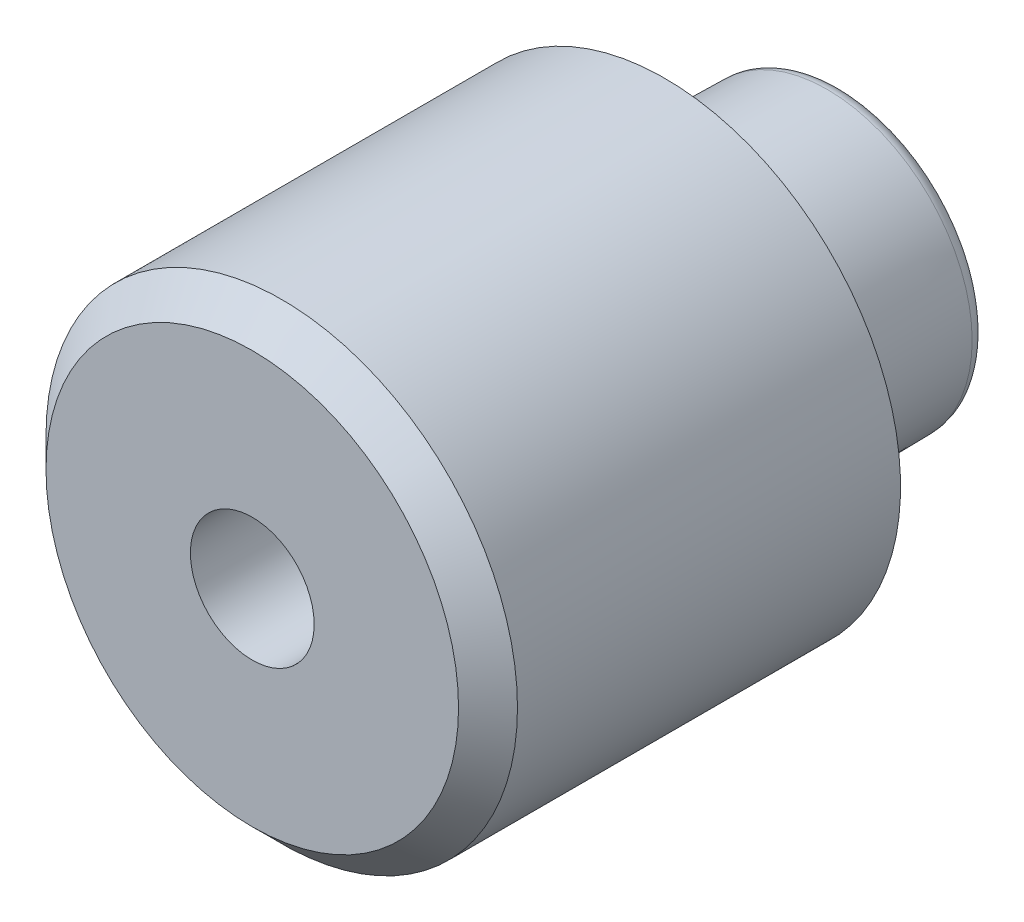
ISO-10303-21;
HEADER;
FILE_DESCRIPTION(('STEP AP214'),'2;1');
FILE_NAME('part.step','',(''),(''),'','','');
FILE_SCHEMA(('AUTOMOTIVE_DESIGN { 1 0 10303 214 1 1 1 1 }'));
ENDSEC;
DATA;
#1=APPLICATION_CONTEXT('core data for automotive mechanical design processes');
#2=APPLICATION_PROTOCOL_DEFINITION('international standard','automotive_design',2000,#1);
#3=PRODUCT_CONTEXT('',#1,'mechanical');
#4=PRODUCT('Part','Part','',(#3));
#5=PRODUCT_RELATED_PRODUCT_CATEGORY('part','',(#4));
#6=PRODUCT_DEFINITION_FORMATION('','',#4);
#7=PRODUCT_DEFINITION_CONTEXT('part definition',#1,'design');
#8=PRODUCT_DEFINITION('design','',#6,#7);
#9=PRODUCT_DEFINITION_SHAPE('','',#8);
#10=(LENGTH_UNIT() NAMED_UNIT(*) SI_UNIT(.MILLI.,.METRE.));
#11=(NAMED_UNIT(*) PLANE_ANGLE_UNIT() SI_UNIT($,.RADIAN.));
#12=(NAMED_UNIT(*) SI_UNIT($,.STERADIAN.) SOLID_ANGLE_UNIT());
#13=UNCERTAINTY_MEASURE_WITH_UNIT(LENGTH_MEASURE(1.E-05),#10,'distance_accuracy_value','');
#14=(GEOMETRIC_REPRESENTATION_CONTEXT(3) GLOBAL_UNCERTAINTY_ASSIGNED_CONTEXT((#13)) GLOBAL_UNIT_ASSIGNED_CONTEXT((#10,
#11,#12)) REPRESENTATION_CONTEXT('',''));
#15=CARTESIAN_POINT('',(0.,0.,0.));
#16=DIRECTION('',(0.,0.,1.));
#17=DIRECTION('',(1.,0.,0.));
#18=AXIS2_PLACEMENT_3D('',#15,#16,#17);
#19=CARTESIAN_POINT('',(0.,0.,10.6862915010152));
#20=DIRECTION('',(0.,0.,-1.));
#21=DIRECTION('',(1.,0.,0.));
#22=AXIS2_PLACEMENT_3D('',#19,#20,#21);
#23=CONICAL_SURFACE('',#22,11.3137084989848,0.785398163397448);
#24=CARTESIAN_POINT('',(1.04744440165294E-13,0.,15.));
#25=DIRECTION('',(0.,0.,-1.));
#26=DIRECTION('',(-1.,0.,0.));
#27=AXIS2_PLACEMENT_3D('',#24,#25,#26);
#28=CIRCLE('',#27,7.);
#29=CARTESIAN_POINT('',(-6.9999999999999,0.,15.));
#30=VERTEX_POINT('',#29);
#31=CARTESIAN_POINT('',(7.00000000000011,0.,15.));
#32=VERTEX_POINT('',#31);
#33=EDGE_CURVE('E59',#30,#32,#28,.T.);
#34=ORIENTED_EDGE('',*,*,#33,.T.);
#35=CARTESIAN_POINT('',(7.00000107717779,0.,14.9999989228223));
#36=CARTESIAN_POINT('',(7.99999833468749,0.,14.0000016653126));
#37=B_SPLINE_CURVE_WITH_KNOTS('',1,(#35,#36),.UNSPECIFIED.,.F.,.F.,(2,2),(0.618718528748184,
0.707106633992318),.UNSPECIFIED.);
#38=CARTESIAN_POINT('',(8.0000000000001,0.,14.));
#39=VERTEX_POINT('',#38);
#40=EDGE_CURVE('E46',#32,#39,#37,.T.);
#41=ORIENTED_EDGE('',*,*,#40,.T.);
#42=CARTESIAN_POINT('',(0.,0.,14.));
#43=DIRECTION('',(0.,0.,1.));
#44=DIRECTION('',(-1.,0.,0.));
#45=AXIS2_PLACEMENT_3D('',#42,#43,#44);
#46=CIRCLE('',#45,8.);
#47=CARTESIAN_POINT('',(-7.9999999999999,0.,14.));
#48=VERTEX_POINT('',#47);
#49=EDGE_CURVE('E97',#39,#48,#46,.T.);
#50=ORIENTED_EDGE('',*,*,#49,.T.);
#51=CARTESIAN_POINT('',(0.,0.,14.));
#52=DIRECTION('',(0.,0.,1.));
#53=DIRECTION('',(-1.,0.,0.));
#54=AXIS2_PLACEMENT_3D('',#51,#52,#53);
#55=CIRCLE('',#54,8.);
#56=EDGE_CURVE('E11',#48,#39,#55,.T.);
#57=ORIENTED_EDGE('',*,*,#56,.T.);
#58=ORIENTED_EDGE('',*,*,#40,.F.);
#59=CARTESIAN_POINT('',(1.04744440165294E-13,0.,15.));
#60=DIRECTION('',(0.,0.,-1.));
#61=DIRECTION('',(-1.,0.,0.));
#62=AXIS2_PLACEMENT_3D('',#59,#60,#61);
#63=CIRCLE('',#62,7.);
#64=EDGE_CURVE('E94',#32,#30,#63,.T.);
#65=ORIENTED_EDGE('',*,*,#64,.T.);
#66=EDGE_LOOP('',(#34,#41,#50,#57,#58,#65));
#67=FACE_BOUND('',#66,.T.);
#68=ADVANCED_FACE('F38',(#67),#23,.T.);
#69=CARTESIAN_POINT('',(0.,0.,8.));
#70=DIRECTION('',(0.,0.,-1.));
#71=DIRECTION('',(-1.,0.,0.));
#72=AXIS2_PLACEMENT_3D('',#69,#70,#71);
#73=CYLINDRICAL_SURFACE('',#72,8.);
#74=ORIENTED_EDGE('',*,*,#49,.F.);
#75=ORIENTED_EDGE('',*,*,#56,.F.);
#76=CARTESIAN_POINT('',(-7.9999999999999,0.,13.9999990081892));
#77=CARTESIAN_POINT('',(-8.,0.,0.999998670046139));
#78=B_SPLINE_CURVE_WITH_KNOTS('',1,(#76,#77),.UNSPECIFIED.,.F.,.F.,(2,2),(0.0833333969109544,
0.916666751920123),.UNSPECIFIED.);
#79=CARTESIAN_POINT('',(-8.,0.,1.00000000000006));
#80=VERTEX_POINT('',#79);
#81=EDGE_CURVE('E132',#48,#80,#78,.T.);
#82=ORIENTED_EDGE('',*,*,#81,.T.);
#83=CARTESIAN_POINT('',(0.,0.,1.));
#84=DIRECTION('',(0.,0.,-1.));
#85=DIRECTION('',(-1.,0.,0.));
#86=AXIS2_PLACEMENT_3D('',#83,#84,#85);
#87=CIRCLE('',#86,8.);
#88=EDGE_CURVE('E137',#80,#80,#87,.T.);
#89=ORIENTED_EDGE('',*,*,#88,.F.);
#90=ORIENTED_EDGE('',*,*,#81,.F.);
#91=EDGE_LOOP('',(#74,#75,#82,#89,#90));
#92=FACE_BOUND('',#91,.T.);
#93=ADVANCED_FACE('F182',(#92),#73,.T.);
#94=CARTESIAN_POINT('',(-9.0999999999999,-14.5492267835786,15.));
#95=DIRECTION('',(0.,0.,1.));
#96=DIRECTION('',(1.,0.,0.));
#97=AXIS2_PLACEMENT_3D('',#94,#95,#96);
#98=PLANE('',#97);
#99=CARTESIAN_POINT('',(0.,0.,14.9999999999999));
#100=DIRECTION('',(0.,0.,1.));
#101=DIRECTION('',(1.,0.,0.));
#102=AXIS2_PLACEMENT_3D('',#99,#100,#101);
#103=CIRCLE('',#102,2.09999999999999);
#104=CARTESIAN_POINT('',(2.09999999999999,0.,14.9999999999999));
#105=VERTEX_POINT('',#104);
#106=EDGE_CURVE('E95',#105,#105,#103,.T.);
#107=ORIENTED_EDGE('',*,*,#106,.F.);
#108=EDGE_LOOP('',(#107));
#109=FACE_BOUND('',#108,.T.);
#110=ORIENTED_EDGE('',*,*,#64,.F.);
#111=ORIENTED_EDGE('',*,*,#33,.F.);
#112=EDGE_LOOP('',(#110,#111));
#113=FACE_BOUND('',#112,.T.);
#114=ADVANCED_FACE('F185',(#109,#113),#98,.T.);
#115=CARTESIAN_POINT('',(0.,0.,-4.5));
#116=DIRECTION('',(0.,0.,-1.));
#117=DIRECTION('',(-1.,0.,0.));
#118=AXIS2_PLACEMENT_3D('',#115,#116,#117);
#119=TOROIDAL_SURFACE('',#118,4.42137604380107,0.5);
#120=CARTESIAN_POINT('',(0.,0.,-4.50872620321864));
#121=DIRECTION('',(0.,0.,-1.));
#122=DIRECTION('',(-1.,0.,0.));
#123=AXIS2_PLACEMENT_3D('',#120,#121,#122);
#124=CIRCLE('',#123,4.92129989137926);
#125=CARTESIAN_POINT('',(-4.9212998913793,0.,-4.50872620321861));
#126=VERTEX_POINT('',#125);
#127=EDGE_CURVE('E138',#126,#126,#124,.T.);
#128=ORIENTED_EDGE('',*,*,#127,.T.);
#129=CARTESIAN_POINT('',(-4.9212998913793,0.,-4.50872620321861));
#130=CARTESIAN_POINT('',(-4.91272467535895,0.,-4.99999999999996));
#131=CARTESIAN_POINT('',(-4.4213760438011,0.,-5.));
#132=(BOUNDED_CURVE() B_SPLINE_CURVE(2,(#129,#130,#131),.UNSPECIFIED.,.F.,
.F.) B_SPLINE_CURVE_WITH_KNOTS((3,3),(0.,0.5),
.UNSPECIFIED.) CURVE() GEOMETRIC_REPRESENTATION_ITEM() RATIONAL_B_SPLINE_CURVE((1.,
0.713250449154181,1.)) REPRESENTATION_ITEM(''));
#133=CARTESIAN_POINT('',(-4.4213760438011,0.,-5.));
#134=VERTEX_POINT('',#133);
#135=EDGE_CURVE('E121',#126,#134,#132,.T.);
#136=ORIENTED_EDGE('',*,*,#135,.T.);
#137=CARTESIAN_POINT('',(0.,0.,-5.));
#138=DIRECTION('',(0.,0.,1.));
#139=DIRECTION('',(-1.,0.,0.));
#140=AXIS2_PLACEMENT_3D('',#137,#138,#139);
#141=CIRCLE('',#140,4.42137604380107);
#142=EDGE_CURVE('E127',#134,#134,#141,.T.);
#143=ORIENTED_EDGE('',*,*,#142,.T.);
#144=ORIENTED_EDGE('',*,*,#135,.F.);
#145=EDGE_LOOP('',(#128,#136,#143,#144));
#146=FACE_BOUND('',#145,.T.);
#147=ADVANCED_FACE('F187',(#146),#119,.T.);
#148=CARTESIAN_POINT('',(0.,0.,0.));
#149=DIRECTION('',(0.,0.,1.));
#150=DIRECTION('',(-1.,0.,0.));
#151=AXIS2_PLACEMENT_3D('',#148,#149,#150);
#152=CONICAL_SURFACE('',#151,5.,0.0174532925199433);
#153=ORIENTED_EDGE('',*,*,#127,.F.);
#154=CARTESIAN_POINT('',(-4.9212998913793,0.,-4.50872620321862));
#155=CARTESIAN_POINT('',(-5.,0.,0.));
#156=B_SPLINE_CURVE_WITH_KNOTS('',1,(#154,#155),.UNSPECIFIED.,.F.,.F.,(2,2),(0.,1.),.UNSPECIFIED.);
#157=CARTESIAN_POINT('',(-5.,0.,0.));
#158=VERTEX_POINT('',#157);
#159=EDGE_CURVE('E110',#126,#158,#156,.T.);
#160=ORIENTED_EDGE('',*,*,#159,.T.);
#161=CARTESIAN_POINT('',(0.,0.,0.));
#162=DIRECTION('',(0.,0.,-1.));
#163=DIRECTION('',(-1.,0.,0.));
#164=AXIS2_PLACEMENT_3D('',#161,#162,#163);
#165=CIRCLE('',#164,5.);
#166=EDGE_CURVE('E116',#158,#158,#165,.T.);
#167=ORIENTED_EDGE('',*,*,#166,.T.);
#168=ORIENTED_EDGE('',*,*,#159,.F.);
#169=EDGE_LOOP('',(#153,#160,#167,#168));
#170=FACE_BOUND('',#169,.T.);
#171=ADVANCED_FACE('F194',(#170),#152,.T.);
#172=CARTESIAN_POINT('',(10.1691649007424,-9.18965753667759,-5.00000000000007));
#173=DIRECTION('',(0.,0.,-1.));
#174=DIRECTION('',(-1.,0.,0.));
#175=AXIS2_PLACEMENT_3D('',#172,#173,#174);
#176=PLANE('',#175);
#177=ORIENTED_EDGE('',*,*,#142,.F.);
#178=EDGE_LOOP('',(#177));
#179=FACE_BOUND('',#178,.T.);
#180=ADVANCED_FACE('F222',(#179),#176,.T.);
#181=CARTESIAN_POINT('',(0.,0.,0.5));
#182=DIRECTION('',(0.,0.,-1.));
#183=DIRECTION('',(-1.,0.,0.));
#184=AXIS2_PLACEMENT_3D('',#181,#182,#183);
#185=CYLINDRICAL_SURFACE('',#184,5.);
#186=CARTESIAN_POINT('',(0.,0.,1.));
#187=DIRECTION('',(0.,0.,1.));
#188=DIRECTION('',(-1.,0.,0.));
#189=AXIS2_PLACEMENT_3D('',#186,#187,#188);
#190=CIRCLE('',#189,5.);
#191=CARTESIAN_POINT('',(-5.,0.,1.00000000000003));
#192=VERTEX_POINT('',#191);
#193=EDGE_CURVE('E105',#192,#192,#190,.T.);
#194=ORIENTED_EDGE('',*,*,#193,.F.);
#195=CARTESIAN_POINT('',(-5.,0.,1.00000305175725));
#196=CARTESIAN_POINT('',(-5.,0.,5.31746910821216E-07));
#197=B_SPLINE_CURVE_WITH_KNOTS('',1,(#195,#196),.UNSPECIFIED.,.F.,.F.,(2,2),(0.0833307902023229,
0.91666622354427),.UNSPECIFIED.);
#198=EDGE_CURVE('E102',#192,#158,#197,.T.);
#199=ORIENTED_EDGE('',*,*,#198,.T.);
#200=ORIENTED_EDGE('',*,*,#166,.F.);
#201=ORIENTED_EDGE('',*,*,#198,.F.);
#202=EDGE_LOOP('',(#194,#199,#200,#201));
#203=FACE_BOUND('',#202,.T.);
#204=ADVANCED_FACE('F231',(#203),#185,.T.);
#205=CARTESIAN_POINT('',(18.4,-16.6276877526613,0.999999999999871));
#206=DIRECTION('',(0.,0.,-1.));
#207=DIRECTION('',(-1.,0.,0.));
#208=AXIS2_PLACEMENT_3D('',#205,#206,#207);
#209=PLANE('',#208);
#210=ORIENTED_EDGE('',*,*,#88,.T.);
#211=EDGE_LOOP('',(#210));
#212=FACE_BOUND('',#211,.T.);
#213=ORIENTED_EDGE('',*,*,#193,.T.);
#214=EDGE_LOOP('',(#213));
#215=FACE_BOUND('',#214,.T.);
#216=ADVANCED_FACE('F88',(#212,#215),#209,.T.);
#217=CARTESIAN_POINT('',(0.,0.,2.99999999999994));
#218=DIRECTION('',(0.,0.,1.));
#219=DIRECTION('',(1.,0.,0.));
#220=AXIS2_PLACEMENT_3D('',#217,#218,#219);
#221=CONICAL_SURFACE('',#220,2.1,1.02974425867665);
#222=CARTESIAN_POINT('',(0.,0.,1.73819270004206));
#223=VERTEX_POINT('',#222);
#224=VERTEX_LOOP('',#223);
#225=FACE_BOUND('',#224,.T.);
#226=CARTESIAN_POINT('',(0.,0.,2.99999999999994));
#227=DIRECTION('',(0.,0.,1.));
#228=DIRECTION('',(1.,0.,0.));
#229=AXIS2_PLACEMENT_3D('',#226,#227,#228);
#230=CIRCLE('',#229,2.1);
#231=CARTESIAN_POINT('',(2.1,0.,2.99999999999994));
#232=VERTEX_POINT('',#231);
#233=EDGE_CURVE('E92',#232,#232,#230,.T.);
#234=ORIENTED_EDGE('',*,*,#233,.T.);
#235=EDGE_LOOP('',(#234));
#236=FACE_BOUND('',#235,.T.);
#237=ADVANCED_FACE('F84',(#225,#236),#221,.F.);
#238=CARTESIAN_POINT('',(0.,0.,14.9999999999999));
#239=DIRECTION('',(0.,0.,1.));
#240=DIRECTION('',(1.,0.,0.));
#241=AXIS2_PLACEMENT_3D('',#238,#239,#240);
#242=CYLINDRICAL_SURFACE('',#241,2.09999999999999);
#243=ORIENTED_EDGE('',*,*,#233,.F.);
#244=EDGE_LOOP('',(#243));
#245=FACE_BOUND('',#244,.T.);
#246=ORIENTED_EDGE('',*,*,#106,.T.);
#247=EDGE_LOOP('',(#246));
#248=FACE_BOUND('',#247,.T.);
#249=ADVANCED_FACE('F87',(#245,#248),#242,.F.);
#250=CLOSED_SHELL('',(#68,#93,#114,#147,#171,#180,#204,#216,#237,#249));
#251=MANIFOLD_SOLID_BREP('B2',#250);
#252=ADVANCED_BREP_SHAPE_REPRESENTATION('',(#18,#251),#14);
#253=SHAPE_DEFINITION_REPRESENTATION(#9,#252);
ENDSEC;
END-ISO-10303-21;
